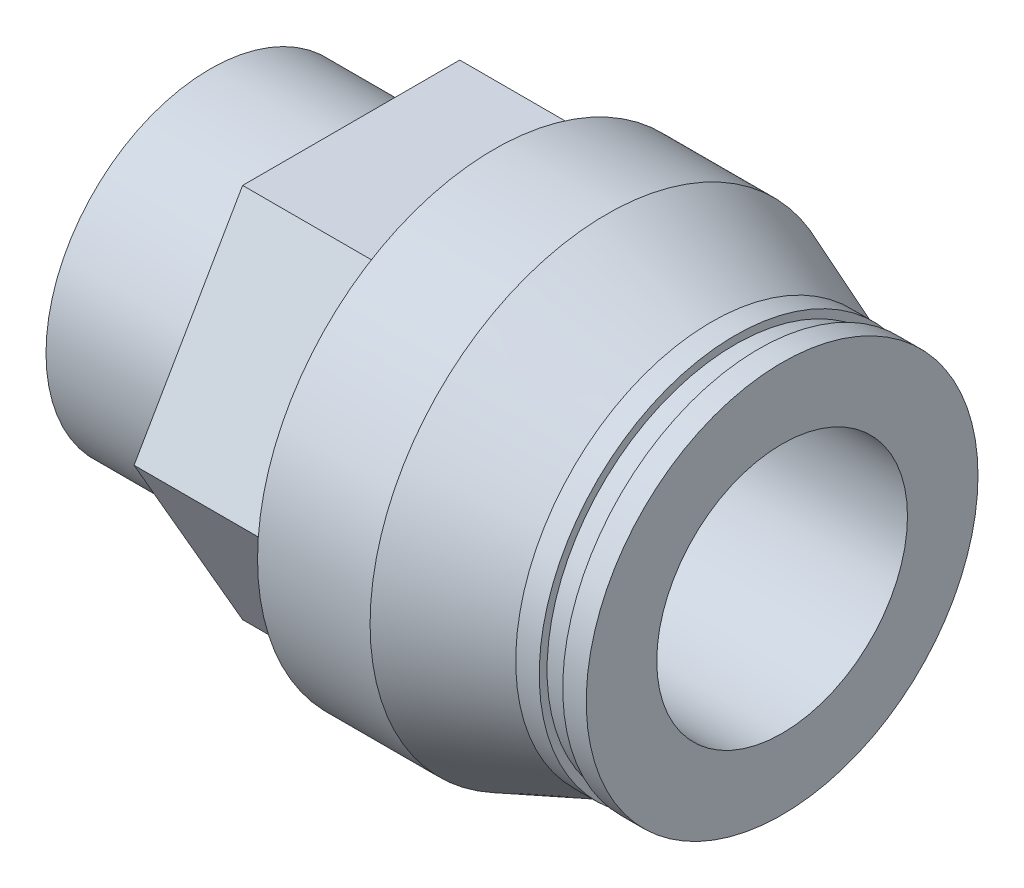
ISO-10303-21;
HEADER;
FILE_DESCRIPTION(('STEP AP214'),'2;1');
FILE_NAME('part.step','',(''),(''),'','','');
FILE_SCHEMA(('AUTOMOTIVE_DESIGN { 1 0 10303 214 1 1 1 1 }'));
ENDSEC;
DATA;
#1=APPLICATION_CONTEXT('core data for automotive mechanical design processes');
#2=APPLICATION_PROTOCOL_DEFINITION('international standard','automotive_design',2000,#1);
#3=PRODUCT_CONTEXT('',#1,'mechanical');
#4=PRODUCT('Part','Part','',(#3));
#5=PRODUCT_RELATED_PRODUCT_CATEGORY('part','',(#4));
#6=PRODUCT_DEFINITION_FORMATION('','',#4);
#7=PRODUCT_DEFINITION_CONTEXT('part definition',#1,'design');
#8=PRODUCT_DEFINITION('design','',#6,#7);
#9=PRODUCT_DEFINITION_SHAPE('','',#8);
#10=(LENGTH_UNIT() NAMED_UNIT(*) SI_UNIT(.MILLI.,.METRE.));
#11=(NAMED_UNIT(*) PLANE_ANGLE_UNIT() SI_UNIT($,.RADIAN.));
#12=(NAMED_UNIT(*) SI_UNIT($,.STERADIAN.) SOLID_ANGLE_UNIT());
#13=UNCERTAINTY_MEASURE_WITH_UNIT(LENGTH_MEASURE(1.E-05),#10,'distance_accuracy_value','');
#14=(GEOMETRIC_REPRESENTATION_CONTEXT(3) GLOBAL_UNCERTAINTY_ASSIGNED_CONTEXT((#13)) GLOBAL_UNIT_ASSIGNED_CONTEXT((#10,
#11,#12)) REPRESENTATION_CONTEXT('',''));
#15=CARTESIAN_POINT('',(0.,0.,0.));
#16=DIRECTION('',(0.,0.,1.));
#17=DIRECTION('',(1.,0.,0.));
#18=AXIS2_PLACEMENT_3D('',#15,#16,#17);
#19=CARTESIAN_POINT('',(9.,10.475,0.));
#20=DIRECTION('',(-1.,0.,0.));
#21=DIRECTION('',(0.,0.,1.));
#22=AXIS2_PLACEMENT_3D('',#19,#20,#21);
#23=PLANE('',#22);
#24=CARTESIAN_POINT('',(9.,0.,0.));
#25=DIRECTION('',(1.,0.,0.));
#26=DIRECTION('',(0.,0.,-1.));
#27=AXIS2_PLACEMENT_3D('',#24,#25,#26);
#28=CIRCLE('',#27,10.475);
#29=CARTESIAN_POINT('',(9.,0.,-10.475));
#30=VERTEX_POINT('',#29);
#31=EDGE_CURVE('E218',#30,#30,#28,.T.);
#32=ORIENTED_EDGE('',*,*,#31,.T.);
#33=EDGE_LOOP('',(#32));
#34=FACE_BOUND('',#33,.T.);
#35=DIRECTION('',(0.,-0.866025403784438,0.5));
#36=VECTOR('',#35,1.);
#37=CARTESIAN_POINT('',(9.,0.,-13.856406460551));
#38=LINE('',#37,#36);
#39=CARTESIAN_POINT('',(9.,0.,-13.856406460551));
#40=VERTEX_POINT('',#39);
#41=CARTESIAN_POINT('',(9.,-12.,-6.9282032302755));
#42=VERTEX_POINT('',#41);
#43=EDGE_CURVE('E127',#40,#42,#38,.T.);
#44=ORIENTED_EDGE('',*,*,#43,.T.);
#45=DIRECTION('',(0.,0.,1.));
#46=VECTOR('',#45,1.);
#47=CARTESIAN_POINT('',(9.,-12.,-6.9282032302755));
#48=LINE('',#47,#46);
#49=CARTESIAN_POINT('',(9.,-12.,6.92820323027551));
#50=VERTEX_POINT('',#49);
#51=EDGE_CURVE('E110',#42,#50,#48,.T.);
#52=ORIENTED_EDGE('',*,*,#51,.T.);
#53=DIRECTION('',(0.,0.866025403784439,0.5));
#54=VECTOR('',#53,1.);
#55=CARTESIAN_POINT('',(9.,-12.,6.92820323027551));
#56=LINE('',#55,#54);
#57=CARTESIAN_POINT('',(9.,0.,13.856406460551));
#58=VERTEX_POINT('',#57);
#59=EDGE_CURVE('E121',#50,#58,#56,.T.);
#60=ORIENTED_EDGE('',*,*,#59,.T.);
#61=DIRECTION('',(0.,0.866025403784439,-0.5));
#62=VECTOR('',#61,1.);
#63=CARTESIAN_POINT('',(9.,0.,13.856406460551));
#64=LINE('',#63,#62);
#65=CARTESIAN_POINT('',(9.,12.,6.92820323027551));
#66=VERTEX_POINT('',#65);
#67=EDGE_CURVE('E30',#58,#66,#64,.T.);
#68=ORIENTED_EDGE('',*,*,#67,.T.);
#69=DIRECTION('',(0.,0.,-1.));
#70=VECTOR('',#69,1.);
#71=CARTESIAN_POINT('',(9.,12.,6.92820323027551));
#72=LINE('',#71,#70);
#73=CARTESIAN_POINT('',(9.,12.,-6.92820323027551));
#74=VERTEX_POINT('',#73);
#75=EDGE_CURVE('E131',#66,#74,#72,.T.);
#76=ORIENTED_EDGE('',*,*,#75,.T.);
#77=DIRECTION('',(0.,-0.866025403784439,-0.5));
#78=VECTOR('',#77,1.);
#79=CARTESIAN_POINT('',(9.,12.,-6.92820323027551));
#80=LINE('',#79,#78);
#81=EDGE_CURVE('E134',#74,#40,#80,.T.);
#82=ORIENTED_EDGE('',*,*,#81,.T.);
#83=EDGE_LOOP('',(#44,#52,#60,#68,#76,#82));
#84=FACE_BOUND('',#83,.T.);
#85=ADVANCED_FACE('F15',(#34,#84),#23,.T.);
#86=CARTESIAN_POINT('',(0.,0.,0.));
#87=DIRECTION('',(-1.,0.,0.));
#88=DIRECTION('',(0.,0.,1.));
#89=AXIS2_PLACEMENT_3D('',#86,#87,#88);
#90=PLANE('',#89);
#91=CARTESIAN_POINT('',(0.,0.,0.));
#92=DIRECTION('',(1.,0.,0.));
#93=DIRECTION('',(0.,0.,-1.));
#94=AXIS2_PLACEMENT_3D('',#91,#92,#93);
#95=CIRCLE('',#94,10.475);
#96=CARTESIAN_POINT('',(0.,0.,-10.475));
#97=VERTEX_POINT('',#96);
#98=EDGE_CURVE('E221',#97,#97,#95,.T.);
#99=ORIENTED_EDGE('',*,*,#98,.F.);
#100=EDGE_LOOP('',(#99));
#101=FACE_BOUND('',#100,.T.);
#102=DIRECTION('',(0.,-0.866025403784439,-0.5));
#103=VECTOR('',#102,1.);
#104=CARTESIAN_POINT('',(0.,0.,5.77350269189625));
#105=LINE('',#104,#103);
#106=CARTESIAN_POINT('',(0.,0.,5.77350269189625));
#107=VERTEX_POINT('',#106);
#108=CARTESIAN_POINT('',(0.,-5.,2.88675134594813));
#109=VERTEX_POINT('',#108);
#110=EDGE_CURVE('E173',#107,#109,#105,.T.);
#111=ORIENTED_EDGE('',*,*,#110,.T.);
#112=DIRECTION('',(0.,0.,-1.));
#113=VECTOR('',#112,1.);
#114=CARTESIAN_POINT('',(0.,-5.,2.88675134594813));
#115=LINE('',#114,#113);
#116=CARTESIAN_POINT('',(0.,-5.,-2.88675134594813));
#117=VERTEX_POINT('',#116);
#118=EDGE_CURVE('E38',#109,#117,#115,.T.);
#119=ORIENTED_EDGE('',*,*,#118,.T.);
#120=DIRECTION('',(0.,0.866025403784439,-0.5));
#121=VECTOR('',#120,1.);
#122=CARTESIAN_POINT('',(0.,-5.,-2.88675134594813));
#123=LINE('',#122,#121);
#124=CARTESIAN_POINT('',(0.,0.,-5.77350269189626));
#125=VERTEX_POINT('',#124);
#126=EDGE_CURVE('E161',#117,#125,#123,.T.);
#127=ORIENTED_EDGE('',*,*,#126,.T.);
#128=DIRECTION('',(0.,0.866025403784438,0.5));
#129=VECTOR('',#128,1.);
#130=CARTESIAN_POINT('',(0.,0.,-5.77350269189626));
#131=LINE('',#130,#129);
#132=CARTESIAN_POINT('',(0.,5.,-2.88675134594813));
#133=VERTEX_POINT('',#132);
#134=EDGE_CURVE('E164',#125,#133,#131,.T.);
#135=ORIENTED_EDGE('',*,*,#134,.T.);
#136=DIRECTION('',(0.,0.,1.));
#137=VECTOR('',#136,1.);
#138=CARTESIAN_POINT('',(0.,5.,-2.88675134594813));
#139=LINE('',#138,#137);
#140=CARTESIAN_POINT('',(0.,5.,2.88675134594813));
#141=VERTEX_POINT('',#140);
#142=EDGE_CURVE('E167',#133,#141,#139,.T.);
#143=ORIENTED_EDGE('',*,*,#142,.T.);
#144=DIRECTION('',(0.,-0.866025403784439,0.5));
#145=VECTOR('',#144,1.);
#146=CARTESIAN_POINT('',(0.,5.,2.88675134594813));
#147=LINE('',#146,#145);
#148=EDGE_CURVE('E170',#141,#107,#147,.T.);
#149=ORIENTED_EDGE('',*,*,#148,.T.);
#150=EDGE_LOOP('',(#111,#119,#127,#135,#143,#149));
#151=FACE_BOUND('',#150,.T.);
#152=ADVANCED_FACE('F17',(#101,#151),#90,.T.);
#153=CARTESIAN_POINT('',(11.5,8.,0.));
#154=DIRECTION('',(1.,0.,0.));
#155=DIRECTION('',(0.,0.,-1.));
#156=AXIS2_PLACEMENT_3D('',#153,#154,#155);
#157=PLANE('',#156);
#158=CARTESIAN_POINT('',(11.5,0.,0.));
#159=DIRECTION('',(1.,0.,0.));
#160=DIRECTION('',(0.,0.,-1.));
#161=AXIS2_PLACEMENT_3D('',#158,#159,#160);
#162=CIRCLE('',#161,8.);
#163=CARTESIAN_POINT('',(11.5,0.,-8.));
#164=VERTEX_POINT('',#163);
#165=EDGE_CURVE('E188',#164,#164,#162,.T.);
#166=ORIENTED_EDGE('',*,*,#165,.T.);
#167=EDGE_LOOP('',(#166));
#168=FACE_BOUND('',#167,.T.);
#169=DIRECTION('',(0.,-0.866025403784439,0.5));
#170=VECTOR('',#169,1.);
#171=CARTESIAN_POINT('',(11.5,3.5,-7.79422863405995));
#172=LINE('',#171,#170);
#173=CARTESIAN_POINT('',(11.5,0.,-5.77350269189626));
#174=VERTEX_POINT('',#173);
#175=CARTESIAN_POINT('',(11.5,-5.,-2.88675134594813));
#176=VERTEX_POINT('',#175);
#177=EDGE_CURVE('E23',#174,#176,#172,.T.);
#178=ORIENTED_EDGE('',*,*,#177,.T.);
#179=DIRECTION('',(0.,0.,1.));
#180=VECTOR('',#179,1.);
#181=CARTESIAN_POINT('',(11.5,-5.,0.));
#182=LINE('',#181,#180);
#183=CARTESIAN_POINT('',(11.5,-5.,2.88675134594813));
#184=VERTEX_POINT('',#183);
#185=EDGE_CURVE('E9',#176,#184,#182,.T.);
#186=ORIENTED_EDGE('',*,*,#185,.T.);
#187=DIRECTION('',(0.,0.866025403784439,0.5));
#188=VECTOR('',#187,1.);
#189=CARTESIAN_POINT('',(11.5,3.5,7.79422863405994));
#190=LINE('',#189,#188);
#191=CARTESIAN_POINT('',(11.5,0.,5.77350269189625));
#192=VERTEX_POINT('',#191);
#193=EDGE_CURVE('E224',#184,#192,#190,.T.);
#194=ORIENTED_EDGE('',*,*,#193,.T.);
#195=DIRECTION('',(0.,0.866025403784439,-0.5));
#196=VECTOR('',#195,1.);
#197=CARTESIAN_POINT('',(11.5,8.5,0.866025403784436));
#198=LINE('',#197,#196);
#199=CARTESIAN_POINT('',(11.5,5.,2.88675134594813));
#200=VERTEX_POINT('',#199);
#201=EDGE_CURVE('E227',#192,#200,#198,.T.);
#202=ORIENTED_EDGE('',*,*,#201,.T.);
#203=DIRECTION('',(0.,0.,-1.));
#204=VECTOR('',#203,1.);
#205=CARTESIAN_POINT('',(11.5,5.,0.));
#206=LINE('',#205,#204);
#207=CARTESIAN_POINT('',(11.5,5.,-2.88675134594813));
#208=VERTEX_POINT('',#207);
#209=EDGE_CURVE('E230',#200,#208,#206,.T.);
#210=ORIENTED_EDGE('',*,*,#209,.T.);
#211=DIRECTION('',(0.,-0.866025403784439,-0.5));
#212=VECTOR('',#211,1.);
#213=CARTESIAN_POINT('',(11.5,8.5,-0.866025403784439));
#214=LINE('',#213,#212);
#215=EDGE_CURVE('E233',#208,#174,#214,.T.);
#216=ORIENTED_EDGE('',*,*,#215,.T.);
#217=EDGE_LOOP('',(#178,#186,#194,#202,#210,#216));
#218=FACE_BOUND('',#217,.T.);
#219=ADVANCED_FACE('F237',(#168,#218),#157,.T.);
#220=CARTESIAN_POINT('',(0.,0.,0.));
#221=DIRECTION('',(1.,0.,0.));
#222=DIRECTION('',(0.,0.,-1.));
#223=AXIS2_PLACEMENT_3D('',#220,#221,#222);
#224=CYLINDRICAL_SURFACE('',#223,10.475);
#225=ORIENTED_EDGE('',*,*,#98,.T.);
#226=EDGE_LOOP('',(#225));
#227=FACE_BOUND('',#226,.T.);
#228=ORIENTED_EDGE('',*,*,#31,.F.);
#229=EDGE_LOOP('',(#228));
#230=FACE_BOUND('',#229,.T.);
#231=ADVANCED_FACE('F278',(#227,#230),#224,.T.);
#232=CARTESIAN_POINT('',(18.125,14.,0.));
#233=DIRECTION('',(-1.,0.,0.));
#234=DIRECTION('',(0.,0.,1.));
#235=AXIS2_PLACEMENT_3D('',#232,#233,#234);
#236=PLANE('',#235);
#237=CARTESIAN_POINT('',(18.125,0.,0.));
#238=DIRECTION('',(1.,0.,0.));
#239=DIRECTION('',(0.,0.,-1.));
#240=AXIS2_PLACEMENT_3D('',#237,#238,#239);
#241=CIRCLE('',#240,15.1001840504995);
#242=CARTESIAN_POINT('',(18.125,0.,-15.1001840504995));
#243=VERTEX_POINT('',#242);
#244=EDGE_CURVE('E215',#243,#243,#241,.T.);
#245=ORIENTED_EDGE('',*,*,#244,.F.);
#246=EDGE_LOOP('',(#245));
#247=FACE_BOUND('',#246,.T.);
#248=DIRECTION('',(0.,-0.866025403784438,0.5));
#249=VECTOR('',#248,1.);
#250=CARTESIAN_POINT('',(18.125,0.,-13.856406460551));
#251=LINE('',#250,#249);
#252=CARTESIAN_POINT('',(18.125,0.,-13.856406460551));
#253=VERTEX_POINT('',#252);
#254=CARTESIAN_POINT('',(18.125,-12.,-6.9282032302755));
#255=VERTEX_POINT('',#254);
#256=EDGE_CURVE('E118',#253,#255,#251,.T.);
#257=ORIENTED_EDGE('',*,*,#256,.F.);
#258=DIRECTION('',(0.,-0.866025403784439,-0.5));
#259=VECTOR('',#258,1.);
#260=CARTESIAN_POINT('',(18.125,12.,-6.92820323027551));
#261=LINE('',#260,#259);
#262=CARTESIAN_POINT('',(18.125,12.,-6.92820323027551));
#263=VERTEX_POINT('',#262);
#264=EDGE_CURVE('E146',#263,#253,#261,.T.);
#265=ORIENTED_EDGE('',*,*,#264,.F.);
#266=DIRECTION('',(0.,0.,-1.));
#267=VECTOR('',#266,1.);
#268=CARTESIAN_POINT('',(18.125,12.,6.92820323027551));
#269=LINE('',#268,#267);
#270=CARTESIAN_POINT('',(18.125,12.,6.92820323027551));
#271=VERTEX_POINT('',#270);
#272=EDGE_CURVE('E143',#271,#263,#269,.T.);
#273=ORIENTED_EDGE('',*,*,#272,.F.);
#274=DIRECTION('',(0.,0.866025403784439,-0.5));
#275=VECTOR('',#274,1.);
#276=CARTESIAN_POINT('',(18.125,0.,13.856406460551));
#277=LINE('',#276,#275);
#278=CARTESIAN_POINT('',(18.125,0.,13.856406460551));
#279=VERTEX_POINT('',#278);
#280=EDGE_CURVE('E140',#279,#271,#277,.T.);
#281=ORIENTED_EDGE('',*,*,#280,.F.);
#282=DIRECTION('',(0.,0.866025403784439,0.5));
#283=VECTOR('',#282,1.);
#284=CARTESIAN_POINT('',(18.125,-12.,6.92820323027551));
#285=LINE('',#284,#283);
#286=CARTESIAN_POINT('',(18.125,-12.,6.92820323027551));
#287=VERTEX_POINT('',#286);
#288=EDGE_CURVE('E138',#287,#279,#285,.T.);
#289=ORIENTED_EDGE('',*,*,#288,.F.);
#290=DIRECTION('',(0.,0.,1.));
#291=VECTOR('',#290,1.);
#292=CARTESIAN_POINT('',(18.125,-12.,-6.9282032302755));
#293=LINE('',#292,#291);
#294=EDGE_CURVE('E113',#255,#287,#293,.T.);
#295=ORIENTED_EDGE('',*,*,#294,.F.);
#296=EDGE_LOOP('',(#257,#265,#273,#281,#289,#295));
#297=FACE_BOUND('',#296,.T.);
#298=ADVANCED_FACE('F276',(#247,#297),#236,.T.);
#299=CARTESIAN_POINT('',(0.,0.,0.));
#300=DIRECTION('',(1.,0.,0.));
#301=DIRECTION('',(0.,0.,-1.));
#302=AXIS2_PLACEMENT_3D('',#299,#300,#301);
#303=CYLINDRICAL_SURFACE('',#302,15.1001840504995);
#304=ORIENTED_EDGE('',*,*,#244,.T.);
#305=EDGE_LOOP('',(#304));
#306=FACE_BOUND('',#305,.T.);
#307=CARTESIAN_POINT('',(25.3061380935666,0.,0.));
#308=DIRECTION('',(1.,0.,0.));
#309=DIRECTION('',(0.,0.,-1.));
#310=AXIS2_PLACEMENT_3D('',#307,#308,#309);
#311=CIRCLE('',#310,15.1001840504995);
#312=CARTESIAN_POINT('',(25.3061380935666,0.,-15.1001840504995));
#313=VERTEX_POINT('',#312);
#314=EDGE_CURVE('E212',#313,#313,#311,.T.);
#315=ORIENTED_EDGE('',*,*,#314,.F.);
#316=EDGE_LOOP('',(#315));
#317=FACE_BOUND('',#316,.T.);
#318=ADVANCED_FACE('F285',(#306,#317),#303,.T.);
#319=CARTESIAN_POINT('',(32.,0.,0.));
#320=DIRECTION('',(-1.,0.,0.));
#321=DIRECTION('',(0.,0.,1.));
#322=AXIS2_PLACEMENT_3D('',#319,#320,#321);
#323=CONICAL_SURFACE('',#322,12.5,0.370503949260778);
#324=ORIENTED_EDGE('',*,*,#314,.T.);
#325=EDGE_LOOP('',(#324));
#326=FACE_BOUND('',#325,.T.);
#327=CARTESIAN_POINT('',(32.,0.,0.));
#328=DIRECTION('',(1.,0.,0.));
#329=DIRECTION('',(0.,0.,-1.));
#330=AXIS2_PLACEMENT_3D('',#327,#328,#329);
#331=CIRCLE('',#330,12.5);
#332=CARTESIAN_POINT('',(32.,0.,-12.5));
#333=VERTEX_POINT('',#332);
#334=EDGE_CURVE('E209',#333,#333,#331,.T.);
#335=ORIENTED_EDGE('',*,*,#334,.F.);
#336=EDGE_LOOP('',(#335));
#337=FACE_BOUND('',#336,.T.);
#338=ADVANCED_FACE('F316',(#326,#337),#323,.T.);
#339=CARTESIAN_POINT('',(0.,0.,0.));
#340=DIRECTION('',(1.,0.,0.));
#341=DIRECTION('',(0.,0.,-1.));
#342=AXIS2_PLACEMENT_3D('',#339,#340,#341);
#343=CYLINDRICAL_SURFACE('',#342,12.5);
#344=ORIENTED_EDGE('',*,*,#334,.T.);
#345=EDGE_LOOP('',(#344));
#346=FACE_BOUND('',#345,.T.);
#347=CARTESIAN_POINT('',(33.5,0.,0.));
#348=DIRECTION('',(1.,0.,0.));
#349=DIRECTION('',(0.,0.,-1.));
#350=AXIS2_PLACEMENT_3D('',#347,#348,#349);
#351=CIRCLE('',#350,12.5);
#352=CARTESIAN_POINT('',(33.5,0.,-12.5));
#353=VERTEX_POINT('',#352);
#354=EDGE_CURVE('E206',#353,#353,#351,.T.);
#355=ORIENTED_EDGE('',*,*,#354,.F.);
#356=EDGE_LOOP('',(#355));
#357=FACE_BOUND('',#356,.T.);
#358=ADVANCED_FACE('F312',(#346,#357),#343,.T.);
#359=CARTESIAN_POINT('',(33.5,12.5,0.));
#360=DIRECTION('',(1.,0.,0.));
#361=DIRECTION('',(0.,0.,-1.));
#362=AXIS2_PLACEMENT_3D('',#359,#360,#361);
#363=PLANE('',#362);
#364=ORIENTED_EDGE('',*,*,#354,.T.);
#365=EDGE_LOOP('',(#364));
#366=FACE_BOUND('',#365,.T.);
#367=CARTESIAN_POINT('',(33.5,0.,0.));
#368=DIRECTION('',(1.,0.,0.));
#369=DIRECTION('',(0.,0.,-1.));
#370=AXIS2_PLACEMENT_3D('',#367,#368,#369);
#371=CIRCLE('',#370,12.);
#372=CARTESIAN_POINT('',(33.5,0.,-12.));
#373=VERTEX_POINT('',#372);
#374=EDGE_CURVE('E203',#373,#373,#371,.T.);
#375=ORIENTED_EDGE('',*,*,#374,.F.);
#376=EDGE_LOOP('',(#375));
#377=FACE_BOUND('',#376,.T.);
#378=ADVANCED_FACE('F308',(#366,#377),#363,.T.);
#379=CARTESIAN_POINT('',(0.,0.,0.));
#380=DIRECTION('',(1.,0.,0.));
#381=DIRECTION('',(0.,0.,-1.));
#382=AXIS2_PLACEMENT_3D('',#379,#380,#381);
#383=CYLINDRICAL_SURFACE('',#382,12.);
#384=ORIENTED_EDGE('',*,*,#374,.T.);
#385=EDGE_LOOP('',(#384));
#386=FACE_BOUND('',#385,.T.);
#387=CARTESIAN_POINT('',(35.,0.,0.));
#388=DIRECTION('',(1.,0.,0.));
#389=DIRECTION('',(0.,0.,-1.));
#390=AXIS2_PLACEMENT_3D('',#387,#388,#389);
#391=CIRCLE('',#390,12.);
#392=CARTESIAN_POINT('',(35.,0.,-12.));
#393=VERTEX_POINT('',#392);
#394=EDGE_CURVE('E200',#393,#393,#391,.T.);
#395=ORIENTED_EDGE('',*,*,#394,.F.);
#396=EDGE_LOOP('',(#395));
#397=FACE_BOUND('',#396,.T.);
#398=ADVANCED_FACE('F304',(#386,#397),#383,.T.);
#399=CARTESIAN_POINT('',(35.,12.,0.));
#400=DIRECTION('',(-1.,0.,0.));
#401=DIRECTION('',(0.,0.,1.));
#402=AXIS2_PLACEMENT_3D('',#399,#400,#401);
#403=PLANE('',#402);
#404=ORIENTED_EDGE('',*,*,#394,.T.);
#405=EDGE_LOOP('',(#404));
#406=FACE_BOUND('',#405,.T.);
#407=CARTESIAN_POINT('',(35.,0.,0.));
#408=DIRECTION('',(1.,0.,0.));
#409=DIRECTION('',(0.,0.,-1.));
#410=AXIS2_PLACEMENT_3D('',#407,#408,#409);
#411=CIRCLE('',#410,12.5);
#412=CARTESIAN_POINT('',(35.,0.,-12.5));
#413=VERTEX_POINT('',#412);
#414=EDGE_CURVE('E197',#413,#413,#411,.T.);
#415=ORIENTED_EDGE('',*,*,#414,.F.);
#416=EDGE_LOOP('',(#415));
#417=FACE_BOUND('',#416,.T.);
#418=ADVANCED_FACE('F300',(#406,#417),#403,.T.);
#419=CARTESIAN_POINT('',(0.,0.,0.));
#420=DIRECTION('',(1.,0.,0.));
#421=DIRECTION('',(0.,0.,-1.));
#422=AXIS2_PLACEMENT_3D('',#419,#420,#421);
#423=CYLINDRICAL_SURFACE('',#422,12.5);
#424=ORIENTED_EDGE('',*,*,#414,.T.);
#425=EDGE_LOOP('',(#424));
#426=FACE_BOUND('',#425,.T.);
#427=CARTESIAN_POINT('',(36.5,0.,0.));
#428=DIRECTION('',(1.,0.,0.));
#429=DIRECTION('',(0.,0.,-1.));
#430=AXIS2_PLACEMENT_3D('',#427,#428,#429);
#431=CIRCLE('',#430,12.5);
#432=CARTESIAN_POINT('',(36.5,0.,-12.5));
#433=VERTEX_POINT('',#432);
#434=EDGE_CURVE('E194',#433,#433,#431,.T.);
#435=ORIENTED_EDGE('',*,*,#434,.F.);
#436=EDGE_LOOP('',(#435));
#437=FACE_BOUND('',#436,.T.);
#438=ADVANCED_FACE('F296',(#426,#437),#423,.T.);
#439=CARTESIAN_POINT('',(36.5,12.5,0.));
#440=DIRECTION('',(1.,0.,0.));
#441=DIRECTION('',(0.,0.,-1.));
#442=AXIS2_PLACEMENT_3D('',#439,#440,#441);
#443=PLANE('',#442);
#444=ORIENTED_EDGE('',*,*,#434,.T.);
#445=EDGE_LOOP('',(#444));
#446=FACE_BOUND('',#445,.T.);
#447=CARTESIAN_POINT('',(36.5,0.,0.));
#448=DIRECTION('',(1.,0.,0.));
#449=DIRECTION('',(0.,0.,-1.));
#450=AXIS2_PLACEMENT_3D('',#447,#448,#449);
#451=CIRCLE('',#450,8.);
#452=CARTESIAN_POINT('',(36.5,0.,-8.));
#453=VERTEX_POINT('',#452);
#454=EDGE_CURVE('E191',#453,#453,#451,.T.);
#455=ORIENTED_EDGE('',*,*,#454,.F.);
#456=EDGE_LOOP('',(#455));
#457=FACE_BOUND('',#456,.T.);
#458=ADVANCED_FACE('F264',(#446,#457),#443,.T.);
#459=CARTESIAN_POINT('',(0.,0.,0.));
#460=DIRECTION('',(1.,0.,0.));
#461=DIRECTION('',(0.,0.,-1.));
#462=AXIS2_PLACEMENT_3D('',#459,#460,#461);
#463=CYLINDRICAL_SURFACE('',#462,8.);
#464=ORIENTED_EDGE('',*,*,#454,.T.);
#465=EDGE_LOOP('',(#464));
#466=FACE_BOUND('',#465,.T.);
#467=ORIENTED_EDGE('',*,*,#165,.F.);
#468=EDGE_LOOP('',(#467));
#469=FACE_BOUND('',#468,.T.);
#470=ADVANCED_FACE('F256',(#466,#469),#463,.F.);
#471=CARTESIAN_POINT('',(36.5,-5.,2.88675134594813));
#472=DIRECTION('',(0.,1.,0.));
#473=DIRECTION('',(0.,0.,1.));
#474=AXIS2_PLACEMENT_3D('',#471,#472,#473);
#475=PLANE('',#474);
#476=DIRECTION('',(-1.,0.,0.));
#477=VECTOR('',#476,1.);
#478=CARTESIAN_POINT('',(36.5,-5.,-2.88675134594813));
#479=LINE('',#478,#477);
#480=EDGE_CURVE('E186',#176,#117,#479,.T.);
#481=ORIENTED_EDGE('',*,*,#480,.T.);
#482=ORIENTED_EDGE('',*,*,#118,.F.);
#483=DIRECTION('',(-1.,0.,0.));
#484=VECTOR('',#483,1.);
#485=CARTESIAN_POINT('',(36.5,-5.,2.88675134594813));
#486=LINE('',#485,#484);
#487=EDGE_CURVE('E176',#184,#109,#486,.T.);
#488=ORIENTED_EDGE('',*,*,#487,.F.);
#489=ORIENTED_EDGE('',*,*,#185,.F.);
#490=EDGE_LOOP('',(#481,#482,#488,#489));
#491=FACE_BOUND('',#490,.T.);
#492=ADVANCED_FACE('F254',(#491),#475,.T.);
#493=CARTESIAN_POINT('',(36.5,-5.,-2.88675134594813));
#494=DIRECTION('',(0.,0.5,0.866025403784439));
#495=DIRECTION('',(0.,-0.866025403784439,0.5));
#496=AXIS2_PLACEMENT_3D('',#493,#494,#495);
#497=PLANE('',#496);
#498=DIRECTION('',(-1.,0.,0.));
#499=VECTOR('',#498,1.);
#500=CARTESIAN_POINT('',(36.5,0.,-5.77350269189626));
#501=LINE('',#500,#499);
#502=EDGE_CURVE('E184',#174,#125,#501,.T.);
#503=ORIENTED_EDGE('',*,*,#502,.T.);
#504=ORIENTED_EDGE('',*,*,#126,.F.);
#505=ORIENTED_EDGE('',*,*,#480,.F.);
#506=ORIENTED_EDGE('',*,*,#177,.F.);
#507=EDGE_LOOP('',(#503,#504,#505,#506));
#508=FACE_BOUND('',#507,.T.);
#509=ADVANCED_FACE('F241',(#508),#497,.T.);
#510=CARTESIAN_POINT('',(36.5,0.,-5.77350269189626));
#511=DIRECTION('',(0.,-0.5,0.866025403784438));
#512=DIRECTION('',(0.,-0.866025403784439,-0.5));
#513=AXIS2_PLACEMENT_3D('',#510,#511,#512);
#514=PLANE('',#513);
#515=DIRECTION('',(-1.,0.,0.));
#516=VECTOR('',#515,1.);
#517=CARTESIAN_POINT('',(36.5,5.,-2.88675134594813));
#518=LINE('',#517,#516);
#519=EDGE_CURVE('E182',#208,#133,#518,.T.);
#520=ORIENTED_EDGE('',*,*,#519,.T.);
#521=ORIENTED_EDGE('',*,*,#134,.F.);
#522=ORIENTED_EDGE('',*,*,#502,.F.);
#523=ORIENTED_EDGE('',*,*,#215,.F.);
#524=EDGE_LOOP('',(#520,#521,#522,#523));
#525=FACE_BOUND('',#524,.T.);
#526=ADVANCED_FACE('F245',(#525),#514,.T.);
#527=CARTESIAN_POINT('',(36.5,5.,-2.88675134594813));
#528=DIRECTION('',(0.,-1.,0.));
#529=DIRECTION('',(0.,0.,-1.));
#530=AXIS2_PLACEMENT_3D('',#527,#528,#529);
#531=PLANE('',#530);
#532=DIRECTION('',(-1.,0.,0.));
#533=VECTOR('',#532,1.);
#534=CARTESIAN_POINT('',(36.5,5.,2.88675134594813));
#535=LINE('',#534,#533);
#536=EDGE_CURVE('E180',#200,#141,#535,.T.);
#537=ORIENTED_EDGE('',*,*,#536,.T.);
#538=ORIENTED_EDGE('',*,*,#142,.F.);
#539=ORIENTED_EDGE('',*,*,#519,.F.);
#540=ORIENTED_EDGE('',*,*,#209,.F.);
#541=EDGE_LOOP('',(#537,#538,#539,#540));
#542=FACE_BOUND('',#541,.T.);
#543=ADVANCED_FACE('F373',(#542),#531,.T.);
#544=CARTESIAN_POINT('',(36.5,5.,2.88675134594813));
#545=DIRECTION('',(0.,-0.5,-0.866025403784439));
#546=DIRECTION('',(0.,0.866025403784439,-0.5));
#547=AXIS2_PLACEMENT_3D('',#544,#545,#546);
#548=PLANE('',#547);
#549=DIRECTION('',(-1.,0.,0.));
#550=VECTOR('',#549,1.);
#551=CARTESIAN_POINT('',(36.5,0.,5.77350269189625));
#552=LINE('',#551,#550);
#553=EDGE_CURVE('E178',#192,#107,#552,.T.);
#554=ORIENTED_EDGE('',*,*,#553,.T.);
#555=ORIENTED_EDGE('',*,*,#148,.F.);
#556=ORIENTED_EDGE('',*,*,#536,.F.);
#557=ORIENTED_EDGE('',*,*,#201,.F.);
#558=EDGE_LOOP('',(#554,#555,#556,#557));
#559=FACE_BOUND('',#558,.T.);
#560=ADVANCED_FACE('F370',(#559),#548,.T.);
#561=CARTESIAN_POINT('',(36.5,0.,5.77350269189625));
#562=DIRECTION('',(0.,0.5,-0.866025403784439));
#563=DIRECTION('',(0.,0.866025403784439,0.5));
#564=AXIS2_PLACEMENT_3D('',#561,#562,#563);
#565=PLANE('',#564);
#566=ORIENTED_EDGE('',*,*,#487,.T.);
#567=ORIENTED_EDGE('',*,*,#110,.F.);
#568=ORIENTED_EDGE('',*,*,#553,.F.);
#569=ORIENTED_EDGE('',*,*,#193,.F.);
#570=EDGE_LOOP('',(#566,#567,#568,#569));
#571=FACE_BOUND('',#570,.T.);
#572=ADVANCED_FACE('F252',(#571),#565,.T.);
#573=CARTESIAN_POINT('',(18.125,-12.,-6.9282032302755));
#574=DIRECTION('',(0.,-1.,0.));
#575=DIRECTION('',(0.,0.,-1.));
#576=AXIS2_PLACEMENT_3D('',#573,#574,#575);
#577=PLANE('',#576);
#578=DIRECTION('',(-1.,0.,0.));
#579=VECTOR('',#578,1.);
#580=CARTESIAN_POINT('',(18.125,-12.,-6.9282032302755));
#581=LINE('',#580,#579);
#582=EDGE_CURVE('E151',#255,#42,#581,.T.);
#583=ORIENTED_EDGE('',*,*,#582,.F.);
#584=ORIENTED_EDGE('',*,*,#294,.T.);
#585=DIRECTION('',(-1.,0.,0.));
#586=VECTOR('',#585,1.);
#587=CARTESIAN_POINT('',(18.125,-12.,6.92820323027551));
#588=LINE('',#587,#586);
#589=EDGE_CURVE('E106',#287,#50,#588,.T.);
#590=ORIENTED_EDGE('',*,*,#589,.T.);
#591=ORIENTED_EDGE('',*,*,#51,.F.);
#592=EDGE_LOOP('',(#583,#584,#590,#591));
#593=FACE_BOUND('',#592,.T.);
#594=ADVANCED_FACE('F108',(#593),#577,.T.);
#595=CARTESIAN_POINT('',(18.125,0.,-13.856406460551));
#596=DIRECTION('',(0.,-0.5,-0.866025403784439));
#597=DIRECTION('',(0.,0.866025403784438,-0.5));
#598=AXIS2_PLACEMENT_3D('',#595,#596,#597);
#599=PLANE('',#598);
#600=DIRECTION('',(-1.,0.,0.));
#601=VECTOR('',#600,1.);
#602=CARTESIAN_POINT('',(18.125,0.,-13.856406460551));
#603=LINE('',#602,#601);
#604=EDGE_CURVE('E153',#253,#40,#603,.T.);
#605=ORIENTED_EDGE('',*,*,#604,.F.);
#606=ORIENTED_EDGE('',*,*,#256,.T.);
#607=ORIENTED_EDGE('',*,*,#582,.T.);
#608=ORIENTED_EDGE('',*,*,#43,.F.);
#609=EDGE_LOOP('',(#605,#606,#607,#608));
#610=FACE_BOUND('',#609,.T.);
#611=ADVANCED_FACE('F367',(#610),#599,.T.);
#612=CARTESIAN_POINT('',(18.125,12.,-6.92820323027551));
#613=DIRECTION('',(0.,0.5,-0.866025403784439));
#614=DIRECTION('',(0.,0.866025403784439,0.5));
#615=AXIS2_PLACEMENT_3D('',#612,#613,#614);
#616=PLANE('',#615);
#617=DIRECTION('',(-1.,0.,0.));
#618=VECTOR('',#617,1.);
#619=CARTESIAN_POINT('',(18.125,12.,-6.92820323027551));
#620=LINE('',#619,#618);
#621=EDGE_CURVE('E155',#263,#74,#620,.T.);
#622=ORIENTED_EDGE('',*,*,#621,.F.);
#623=ORIENTED_EDGE('',*,*,#264,.T.);
#624=ORIENTED_EDGE('',*,*,#604,.T.);
#625=ORIENTED_EDGE('',*,*,#81,.F.);
#626=EDGE_LOOP('',(#622,#623,#624,#625));
#627=FACE_BOUND('',#626,.T.);
#628=ADVANCED_FACE('F349',(#627),#616,.T.);
#629=CARTESIAN_POINT('',(18.125,12.,6.92820323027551));
#630=DIRECTION('',(0.,1.,0.));
#631=DIRECTION('',(0.,0.,1.));
#632=AXIS2_PLACEMENT_3D('',#629,#630,#631);
#633=PLANE('',#632);
#634=DIRECTION('',(-1.,0.,0.));
#635=VECTOR('',#634,1.);
#636=CARTESIAN_POINT('',(18.125,12.,6.92820323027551));
#637=LINE('',#636,#635);
#638=EDGE_CURVE('E157',#271,#66,#637,.T.);
#639=ORIENTED_EDGE('',*,*,#638,.F.);
#640=ORIENTED_EDGE('',*,*,#272,.T.);
#641=ORIENTED_EDGE('',*,*,#621,.T.);
#642=ORIENTED_EDGE('',*,*,#75,.F.);
#643=EDGE_LOOP('',(#639,#640,#641,#642));
#644=FACE_BOUND('',#643,.T.);
#645=ADVANCED_FACE('F353',(#644),#633,.T.);
#646=CARTESIAN_POINT('',(18.125,0.,13.856406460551));
#647=DIRECTION('',(0.,0.5,0.866025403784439));
#648=DIRECTION('',(0.,-0.866025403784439,0.5));
#649=AXIS2_PLACEMENT_3D('',#646,#647,#648);
#650=PLANE('',#649);
#651=DIRECTION('',(-1.,0.,0.));
#652=VECTOR('',#651,1.);
#653=CARTESIAN_POINT('',(18.125,0.,13.856406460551));
#654=LINE('',#653,#652);
#655=EDGE_CURVE('E117',#279,#58,#654,.T.);
#656=ORIENTED_EDGE('',*,*,#655,.F.);
#657=ORIENTED_EDGE('',*,*,#280,.T.);
#658=ORIENTED_EDGE('',*,*,#638,.T.);
#659=ORIENTED_EDGE('',*,*,#67,.F.);
#660=EDGE_LOOP('',(#656,#657,#658,#659));
#661=FACE_BOUND('',#660,.T.);
#662=ADVANCED_FACE('F354',(#661),#650,.T.);
#663=CARTESIAN_POINT('',(18.125,-12.,6.92820323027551));
#664=DIRECTION('',(0.,-0.5,0.866025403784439));
#665=DIRECTION('',(0.,-0.866025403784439,-0.5));
#666=AXIS2_PLACEMENT_3D('',#663,#664,#665);
#667=PLANE('',#666);
#668=ORIENTED_EDGE('',*,*,#589,.F.);
#669=ORIENTED_EDGE('',*,*,#288,.T.);
#670=ORIENTED_EDGE('',*,*,#655,.T.);
#671=ORIENTED_EDGE('',*,*,#59,.F.);
#672=EDGE_LOOP('',(#668,#669,#670,#671));
#673=FACE_BOUND('',#672,.T.);
#674=ADVANCED_FACE('F122',(#673),#667,.T.);
#675=CLOSED_SHELL('',(#85,#152,#219,#231,#298,#318,#338,#358,#378,#398,#418,#438,#458,#470,#492,
#509,#526,#543,#560,#572,#594,#611,#628,#645,#662,#674));
#676=MANIFOLD_SOLID_BREP('B1',#675);
#677=ADVANCED_BREP_SHAPE_REPRESENTATION('',(#18,#676),#14);
#678=SHAPE_DEFINITION_REPRESENTATION(#9,#677);
ENDSEC;
END-ISO-10303-21;
